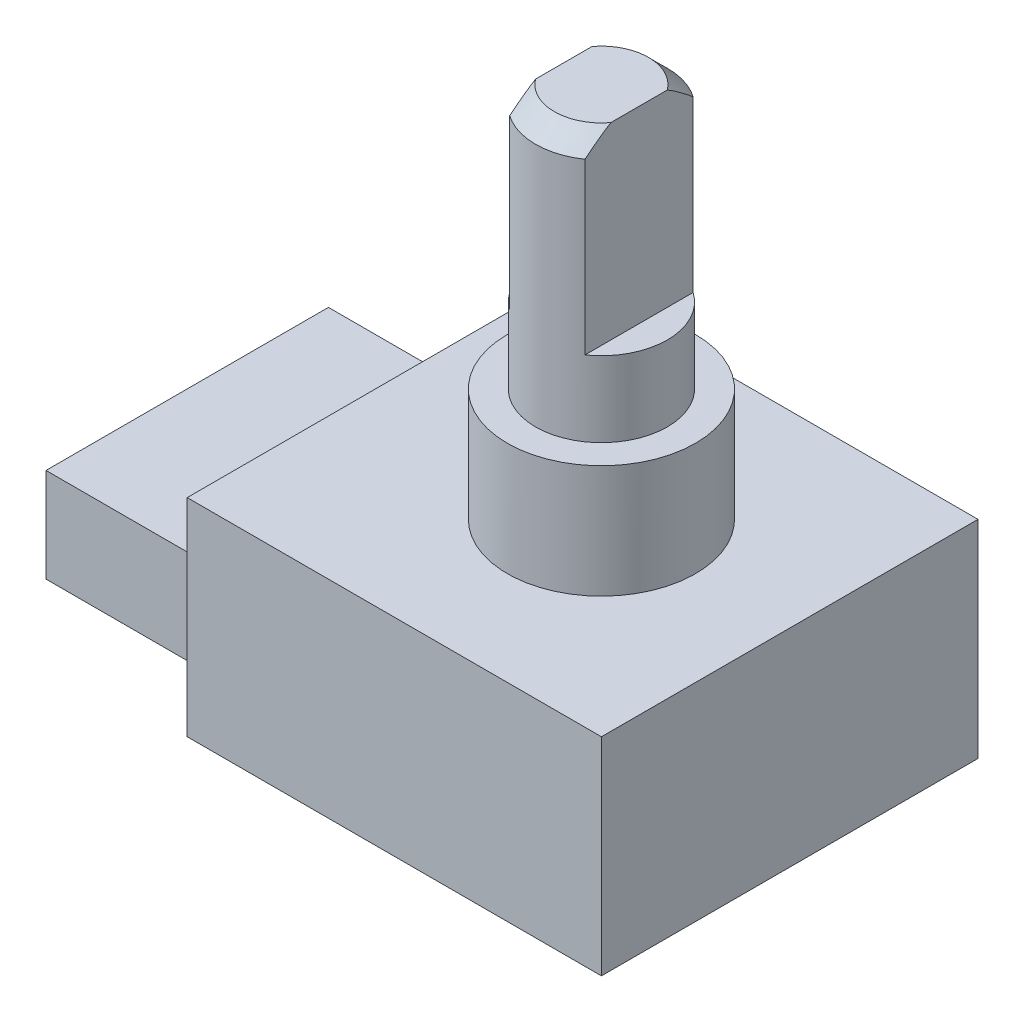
ISO-10303-21;
HEADER;
FILE_DESCRIPTION(('STEP AP214'),'2;1');
FILE_NAME('part.step','',(''),(''),'','','');
FILE_SCHEMA(('AUTOMOTIVE_DESIGN { 1 0 10303 214 1 1 1 1 }'));
ENDSEC;
DATA;
#1=APPLICATION_CONTEXT('core data for automotive mechanical design processes');
#2=APPLICATION_PROTOCOL_DEFINITION('international standard','automotive_design',2000,#1);
#3=PRODUCT_CONTEXT('',#1,'mechanical');
#4=PRODUCT('Part','Part','',(#3));
#5=PRODUCT_RELATED_PRODUCT_CATEGORY('part','',(#4));
#6=PRODUCT_DEFINITION_FORMATION('','',#4);
#7=PRODUCT_DEFINITION_CONTEXT('part definition',#1,'design');
#8=PRODUCT_DEFINITION('design','',#6,#7);
#9=PRODUCT_DEFINITION_SHAPE('','',#8);
#10=(LENGTH_UNIT() NAMED_UNIT(*) SI_UNIT(.MILLI.,.METRE.));
#11=(NAMED_UNIT(*) PLANE_ANGLE_UNIT() SI_UNIT($,.RADIAN.));
#12=(NAMED_UNIT(*) SI_UNIT($,.STERADIAN.) SOLID_ANGLE_UNIT());
#13=UNCERTAINTY_MEASURE_WITH_UNIT(LENGTH_MEASURE(1.E-05),#10,'distance_accuracy_value','');
#14=(GEOMETRIC_REPRESENTATION_CONTEXT(3) GLOBAL_UNCERTAINTY_ASSIGNED_CONTEXT((#13)) GLOBAL_UNIT_ASSIGNED_CONTEXT((#10,
#11,#12)) REPRESENTATION_CONTEXT('',''));
#15=CARTESIAN_POINT('',(0.,0.,0.));
#16=DIRECTION('',(0.,0.,1.));
#17=DIRECTION('',(1.,0.,0.));
#18=AXIS2_PLACEMENT_3D('',#15,#16,#17);
#19=CARTESIAN_POINT('',(-6.,-5.5,5.));
#20=DIRECTION('',(-1.,0.,0.));
#21=DIRECTION('',(0.,0.,1.));
#22=AXIS2_PLACEMENT_3D('',#19,#20,#21);
#23=PLANE('',#22);
#24=DIRECTION('',(0.,0.,1.));
#25=VECTOR('',#24,1.);
#26=CARTESIAN_POINT('',(-6.,0.,5.));
#27=LINE('',#26,#25);
#28=CARTESIAN_POINT('',(-6.,0.,-5.));
#29=VERTEX_POINT('',#28);
#30=CARTESIAN_POINT('',(-6.,0.,5.));
#31=VERTEX_POINT('',#30);
#32=EDGE_CURVE('E184',#29,#31,#27,.T.);
#33=ORIENTED_EDGE('',*,*,#32,.F.);
#34=DIRECTION('',(0.,1.,0.));
#35=VECTOR('',#34,1.);
#36=CARTESIAN_POINT('',(-6.,-5.5,-5.));
#37=LINE('',#36,#35);
#38=CARTESIAN_POINT('',(-6.,-5.5,-5.));
#39=VERTEX_POINT('',#38);
#40=EDGE_CURVE('E194',#39,#29,#37,.T.);
#41=ORIENTED_EDGE('',*,*,#40,.F.);
#42=DIRECTION('',(0.,0.,1.));
#43=VECTOR('',#42,1.);
#44=CARTESIAN_POINT('',(-6.,-5.5,5.));
#45=LINE('',#44,#43);
#46=CARTESIAN_POINT('',(-6.,-5.5,5.));
#47=VERTEX_POINT('',#46);
#48=EDGE_CURVE('E175',#39,#47,#45,.T.);
#49=ORIENTED_EDGE('',*,*,#48,.T.);
#50=DIRECTION('',(0.,1.,0.));
#51=VECTOR('',#50,1.);
#52=CARTESIAN_POINT('',(-6.,-5.5,5.));
#53=LINE('',#52,#51);
#54=EDGE_CURVE('E192',#47,#31,#53,.T.);
#55=ORIENTED_EDGE('',*,*,#54,.T.);
#56=EDGE_LOOP('',(#33,#41,#49,#55));
#57=FACE_BOUND('',#56,.T.);
#58=DIRECTION('',(0.,0.,-1.));
#59=VECTOR('',#58,1.);
#60=CARTESIAN_POINT('',(-6.,-2.5,-3.75));
#61=LINE('',#60,#59);
#62=CARTESIAN_POINT('',(-6.,-2.5,3.75));
#63=VERTEX_POINT('',#62);
#64=CARTESIAN_POINT('',(-6.,-2.5,-3.75));
#65=VERTEX_POINT('',#64);
#66=EDGE_CURVE('E468',#63,#65,#61,.T.);
#67=ORIENTED_EDGE('',*,*,#66,.F.);
#68=DIRECTION('',(0.,1.,0.));
#69=VECTOR('',#68,1.);
#70=CARTESIAN_POINT('',(-6.,-5.,3.75));
#71=LINE('',#70,#69);
#72=CARTESIAN_POINT('',(-6.,-5.,3.75));
#73=VERTEX_POINT('',#72);
#74=EDGE_CURVE('E158',#73,#63,#71,.T.);
#75=ORIENTED_EDGE('',*,*,#74,.F.);
#76=DIRECTION('',(0.,0.,1.));
#77=VECTOR('',#76,1.);
#78=CARTESIAN_POINT('',(-6.,-5.,-3.75));
#79=LINE('',#78,#77);
#80=CARTESIAN_POINT('',(-6.,-5.,-3.75));
#81=VERTEX_POINT('',#80);
#82=EDGE_CURVE('E154',#81,#73,#79,.T.);
#83=ORIENTED_EDGE('',*,*,#82,.F.);
#84=DIRECTION('',(0.,-1.,0.));
#85=VECTOR('',#84,1.);
#86=CARTESIAN_POINT('',(-6.,-5.,-3.75));
#87=LINE('',#86,#85);
#88=EDGE_CURVE('E465',#65,#81,#87,.T.);
#89=ORIENTED_EDGE('',*,*,#88,.F.);
#90=EDGE_LOOP('',(#67,#75,#83,#89));
#91=FACE_BOUND('',#90,.T.);
#92=ADVANCED_FACE('F33',(#57,#91),#23,.T.);
#93=CARTESIAN_POINT('',(0.,10.,0.));
#94=DIRECTION('',(0.,-1.,0.));
#95=DIRECTION('',(0.,0.,-1.));
#96=AXIS2_PLACEMENT_3D('',#93,#94,#95);
#97=CONICAL_SURFACE('',#96,1.25,0.785398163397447);
#98=CARTESIAN_POINT('',(-0.999999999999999,7.37847965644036,3.74014301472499));
#99=CARTESIAN_POINT('',(-0.999999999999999,7.45812378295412,3.65769830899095));
#100=CARTESIAN_POINT('',(-0.999999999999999,7.53768026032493,3.57516874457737));
#101=CARTESIAN_POINT('',(-0.999999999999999,7.69657097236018,3.40989425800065));
#102=CARTESIAN_POINT('',(-0.999999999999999,7.77590520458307,3.32714933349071));
#103=CARTESIAN_POINT('',(-0.999999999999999,8.01357246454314,3.07845151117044));
#104=CARTESIAN_POINT('',(-1.,8.17149860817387,2.91210935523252));
#105=CARTESIAN_POINT('',(-1.,8.48269927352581,2.58092271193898));
#106=CARTESIAN_POINT('',(-1.,8.63600558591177,2.41610827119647));
#107=CARTESIAN_POINT('',(-1.,8.86373760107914,2.16687794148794));
#108=CARTESIAN_POINT('',(-1.,8.93926988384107,2.08347449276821));
#109=CARTESIAN_POINT('',(-1.,9.08929682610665,1.91573988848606));
#110=CARTESIAN_POINT('',(-1.,9.16379151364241,1.83140875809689));
#111=CARTESIAN_POINT('',(-1.,9.28550582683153,1.69114940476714));
#112=CARTESIAN_POINT('',(-1.,9.3331575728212,1.63559662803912));
#113=CARTESIAN_POINT('',(-1.,9.42763505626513,1.52378175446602));
#114=CARTESIAN_POINT('',(-1.,9.47446071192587,1.46751958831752));
#115=CARTESIAN_POINT('',(-1.,9.56747397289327,1.35351140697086));
#116=CARTESIAN_POINT('',(-1.,9.61365026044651,1.29575612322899));
#117=CARTESIAN_POINT('',(-1.,9.7044374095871,1.17902994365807));
#118=CARTESIAN_POINT('',(-1.,9.74904842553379,1.12005916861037));
#119=CARTESIAN_POINT('',(-1.,9.83667548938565,0.999611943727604));
#120=CARTESIAN_POINT('',(-1.,9.8796588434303,0.938111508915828));
#121=CARTESIAN_POINT('',(-1.,9.96225285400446,0.812726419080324));
#122=CARTESIAN_POINT('',(-1.,10.001858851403,0.748838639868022));
#123=CARTESIAN_POINT('',(-1.,10.0752663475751,0.618758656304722));
#124=CARTESIAN_POINT('',(-1.,10.109131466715,0.55260304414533));
#125=CARTESIAN_POINT('',(-1.,10.1683905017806,0.416628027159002));
#126=CARTESIAN_POINT('',(-1.,10.1938125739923,0.346821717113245));
#127=CARTESIAN_POINT('',(-1.,10.2215841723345,0.242195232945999));
#128=CARTESIAN_POINT('',(-1.,10.2289926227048,0.208718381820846));
#129=CARTESIAN_POINT('',(-1.,10.2406262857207,0.141206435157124));
#130=CARTESIAN_POINT('',(-1.,10.2448518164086,0.107171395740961));
#131=CARTESIAN_POINT('',(-1.,10.2498165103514,0.0389626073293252));
#132=CARTESIAN_POINT('',(-1.,10.2505679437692,0.00478977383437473));
#133=CARTESIAN_POINT('',(-1.,10.2485720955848,-0.063446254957));
#134=CARTESIAN_POINT('',(-1.,10.2458245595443,-0.0975094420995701));
#135=CARTESIAN_POINT('',(-1.,10.2326534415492,-0.198485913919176));
#136=CARTESIAN_POINT('',(-1.,10.2173405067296,-0.264795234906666));
#137=CARTESIAN_POINT('',(-1.,10.1869693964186,-0.361949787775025));
#138=CARTESIAN_POINT('',(-1.,10.1755588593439,-0.394058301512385));
#139=CARTESIAN_POINT('',(-1.,10.1507071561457,-0.457481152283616));
#140=CARTESIAN_POINT('',(-1.,10.1372663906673,-0.488795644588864));
#141=CARTESIAN_POINT('',(-1.,10.0950781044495,-0.58030178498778));
#142=CARTESIAN_POINT('',(-1.,10.0640041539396,-0.639412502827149));
#143=CARTESIAN_POINT('',(-1.,9.99771844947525,-0.755290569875));
#144=CARTESIAN_POINT('',(-1.,9.96250174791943,-0.81205500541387));
#145=CARTESIAN_POINT('',(-1.,9.88914738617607,-0.923964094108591));
#146=CARTESIAN_POINT('',(-1.,9.85099886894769,-0.97910156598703));
#147=CARTESIAN_POINT('',(-1.,9.77277718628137,-1.0879408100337));
#148=CARTESIAN_POINT('',(-1.,9.73270494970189,-1.14164325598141));
#149=CARTESIAN_POINT('',(-1.,9.65063514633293,-1.2486640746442));
#150=CARTESIAN_POINT('',(-1.,9.60861932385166,-1.30196838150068));
#151=CARTESIAN_POINT('',(-1.,9.52352678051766,-1.40772530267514));
#152=CARTESIAN_POINT('',(-1.,9.48044999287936,-1.46017786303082));
#153=CARTESIAN_POINT('',(-1.,9.35023924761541,-1.61629570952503));
#154=CARTESIAN_POINT('',(-1.,9.26192557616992,-1.71897545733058));
#155=CARTESIAN_POINT('',(-1.,9.09901124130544,-1.90482501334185));
#156=CARTESIAN_POINT('',(-1.,9.02471531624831,-1.98826458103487));
#157=CARTESIAN_POINT('',(-1.,8.87518823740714,-2.15430555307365));
#158=CARTESIAN_POINT('',(-1.,8.79995705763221,-2.23690693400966));
#159=CARTESIAN_POINT('',(-1.,8.57312266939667,-2.48394235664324));
#160=CARTESIAN_POINT('',(-1.,8.4205159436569,-2.64745315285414));
#161=CARTESIAN_POINT('',(-1.,8.12005063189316,-2.96635625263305));
#162=CARTESIAN_POINT('',(-0.999999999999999,7.97225355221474,-3.12180679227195));
#163=CARTESIAN_POINT('',(-0.999999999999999,7.74994645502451,-3.35423325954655));
#164=CARTESIAN_POINT('',(-0.999999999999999,7.67578335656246,-3.43154131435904));
#165=CARTESIAN_POINT('',(-0.999999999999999,7.52726566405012,-3.58597203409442));
#166=CARTESIAN_POINT('',(-0.999999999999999,7.45291107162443,-3.66309470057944));
#167=CARTESIAN_POINT('',(-0.999999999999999,7.37847965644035,-3.74014301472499));
#168=B_SPLINE_CURVE_WITH_KNOTS('',3,(#98,#99,#100,#101,#102,#103,#104,#105,#106,#107,#108,#109,
#110,#111,#112,#113,#114,#115,#116,#117,#118,#119,#120,#121,#122,#123,#124,#125,#126,#127,#128,
#129,#130,#131,#132,#133,#134,#135,#136,#137,#138,#139,#140,#141,#142,#143,#144,#145,#146,#147,
#148,#149,#150,#151,#152,#153,#154,#155,#156,#157,#158,#159,#160,#161,#162,#163,#164,#165,#166,
#167),.UNSPECIFIED.,.F.,.F.,(4,2,2,2,2,2,2,2,2,2,2,2,2,2,2,2,2,2,2,2,2,2,2,2,2,2,2,2,2,2,2,2,2,
2,4),(0.,0.343893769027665,0.687791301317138,1.37589449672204,2.05114695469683,2.38870835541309,
2.72626061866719,2.94582517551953,3.16541135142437,3.38722873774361,3.60902418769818,
3.83405004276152,4.05938146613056,4.28202423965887,4.50391689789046,4.60664819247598,
4.70936922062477,4.81172716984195,4.91409256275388,5.11702527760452,5.21921139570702,
5.3213773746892,5.52143783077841,5.72173968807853,5.92282279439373,6.12380976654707,
6.32740925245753,6.53102158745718,6.9372774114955,7.27244062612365,7.60761317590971,
8.27857837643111,8.92206442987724,9.24345220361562,9.56483725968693),.UNSPECIFIED.);
#169=CARTESIAN_POINT('',(-1.,9.49999999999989,1.43614066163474));
#170=VERTEX_POINT('',#169);
#171=CARTESIAN_POINT('',(-1.,10.,0.749999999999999));
#172=VERTEX_POINT('',#171);
#173=EDGE_CURVE('E42',#170,#172,#168,.T.);
#174=ORIENTED_EDGE('',*,*,#173,.F.);
#175=CARTESIAN_POINT('',(0.,9.5,0.));
#176=DIRECTION('',(0.,1.,0.));
#177=DIRECTION('',(0.,0.,1.));
#178=AXIS2_PLACEMENT_3D('',#175,#176,#177);
#179=CIRCLE('',#178,1.75);
#180=CARTESIAN_POINT('',(1.,9.49999999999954,1.43614066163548));
#181=VERTEX_POINT('',#180);
#182=EDGE_CURVE('E232',#181,#170,#179,.F.);
#183=ORIENTED_EDGE('',*,*,#182,.F.);
#184=CARTESIAN_POINT('',(1.,7.37847965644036,-3.74014301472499));
#185=CARTESIAN_POINT('',(1.,7.45812378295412,-3.65769830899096));
#186=CARTESIAN_POINT('',(1.,7.53768026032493,-3.57516874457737));
#187=CARTESIAN_POINT('',(1.,7.69657097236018,-3.40989425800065));
#188=CARTESIAN_POINT('',(1.,7.77590520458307,-3.32714933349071));
#189=CARTESIAN_POINT('',(1.,8.01357246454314,-3.07845151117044));
#190=CARTESIAN_POINT('',(1.,8.17149860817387,-2.91210935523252));
#191=CARTESIAN_POINT('',(1.,8.48269927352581,-2.58092271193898));
#192=CARTESIAN_POINT('',(1.,8.63600558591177,-2.41610827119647));
#193=CARTESIAN_POINT('',(1.,8.86373760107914,-2.16687794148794));
#194=CARTESIAN_POINT('',(1.,8.93926988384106,-2.08347449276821));
#195=CARTESIAN_POINT('',(1.,9.08929682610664,-1.91573988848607));
#196=CARTESIAN_POINT('',(1.,9.16379151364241,-1.83140875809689));
#197=CARTESIAN_POINT('',(1.,9.28550582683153,-1.69114940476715));
#198=CARTESIAN_POINT('',(1.,9.3331575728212,-1.63559662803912));
#199=CARTESIAN_POINT('',(1.,9.42763505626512,-1.52378175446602));
#200=CARTESIAN_POINT('',(1.,9.47446071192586,-1.46751958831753));
#201=CARTESIAN_POINT('',(1.,9.56747397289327,-1.35351140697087));
#202=CARTESIAN_POINT('',(1.,9.6136502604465,-1.29575612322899));
#203=CARTESIAN_POINT('',(1.,9.7044374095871,-1.17902994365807));
#204=CARTESIAN_POINT('',(1.,9.74904842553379,-1.12005916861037));
#205=CARTESIAN_POINT('',(1.,9.83667548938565,-0.999611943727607));
#206=CARTESIAN_POINT('',(1.,9.8796588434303,-0.93811150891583));
#207=CARTESIAN_POINT('',(1.,9.96225285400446,-0.812726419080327));
#208=CARTESIAN_POINT('',(1.,10.001858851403,-0.748838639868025));
#209=CARTESIAN_POINT('',(1.,10.0752663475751,-0.618758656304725));
#210=CARTESIAN_POINT('',(1.,10.109131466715,-0.552603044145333));
#211=CARTESIAN_POINT('',(1.,10.1683905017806,-0.416628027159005));
#212=CARTESIAN_POINT('',(1.,10.1938125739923,-0.346821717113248));
#213=CARTESIAN_POINT('',(1.,10.2215841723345,-0.242195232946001));
#214=CARTESIAN_POINT('',(1.,10.2289926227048,-0.208718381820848));
#215=CARTESIAN_POINT('',(1.,10.2406262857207,-0.141206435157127));
#216=CARTESIAN_POINT('',(1.,10.2448518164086,-0.107171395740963));
#217=CARTESIAN_POINT('',(1.,10.2498165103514,-0.0389626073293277));
#218=CARTESIAN_POINT('',(1.,10.2505679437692,-0.0047897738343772));
#219=CARTESIAN_POINT('',(1.,10.2485720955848,0.0634462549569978));
#220=CARTESIAN_POINT('',(1.,10.2458245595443,0.0975094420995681));
#221=CARTESIAN_POINT('',(1.,10.2326534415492,0.198485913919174));
#222=CARTESIAN_POINT('',(1.,10.2173405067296,0.264795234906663));
#223=CARTESIAN_POINT('',(1.,10.1869693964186,0.361949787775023));
#224=CARTESIAN_POINT('',(1.,10.1755588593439,0.394058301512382));
#225=CARTESIAN_POINT('',(1.,10.1507071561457,0.457481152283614));
#226=CARTESIAN_POINT('',(1.,10.1372663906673,0.488795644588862));
#227=CARTESIAN_POINT('',(1.,10.0950781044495,0.580301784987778));
#228=CARTESIAN_POINT('',(1.,10.0640041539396,0.639412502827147));
#229=CARTESIAN_POINT('',(1.,9.99771844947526,0.755290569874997));
#230=CARTESIAN_POINT('',(1.,9.96250174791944,0.812055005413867));
#231=CARTESIAN_POINT('',(1.,9.88914738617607,0.923964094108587));
#232=CARTESIAN_POINT('',(1.,9.8509988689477,0.979101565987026));
#233=CARTESIAN_POINT('',(1.,9.77277718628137,1.0879408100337));
#234=CARTESIAN_POINT('',(1.,9.73270494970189,1.14164325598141));
#235=CARTESIAN_POINT('',(1.,9.65063514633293,1.2486640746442));
#236=CARTESIAN_POINT('',(1.,9.60861932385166,1.30196838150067));
#237=CARTESIAN_POINT('',(1.,9.52352678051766,1.40772530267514));
#238=CARTESIAN_POINT('',(1.,9.48044999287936,1.46017786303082));
#239=CARTESIAN_POINT('',(1.,9.35023924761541,1.61629570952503));
#240=CARTESIAN_POINT('',(1.,9.26192557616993,1.71897545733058));
#241=CARTESIAN_POINT('',(1.,9.09901124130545,1.90482501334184));
#242=CARTESIAN_POINT('',(1.,9.02471531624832,1.98826458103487));
#243=CARTESIAN_POINT('',(1.,8.87518823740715,2.15430555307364));
#244=CARTESIAN_POINT('',(1.,8.79995705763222,2.23690693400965));
#245=CARTESIAN_POINT('',(1.,8.57312266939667,2.48394235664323));
#246=CARTESIAN_POINT('',(1.,8.4205159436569,2.64745315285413));
#247=CARTESIAN_POINT('',(1.,8.12005063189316,2.96635625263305));
#248=CARTESIAN_POINT('',(1.,7.97225355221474,3.12180679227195));
#249=CARTESIAN_POINT('',(1.,7.74994645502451,3.35423325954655));
#250=CARTESIAN_POINT('',(1.,7.67578335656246,3.43154131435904));
#251=CARTESIAN_POINT('',(1.,7.52726566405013,3.58597203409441));
#252=CARTESIAN_POINT('',(1.,7.45291107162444,3.66309470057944));
#253=CARTESIAN_POINT('',(1.,7.37847965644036,3.74014301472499));
#254=B_SPLINE_CURVE_WITH_KNOTS('',3,(#184,#185,#186,#187,#188,#189,#190,#191,#192,#193,#194,
#195,#196,#197,#198,#199,#200,#201,#202,#203,#204,#205,#206,#207,#208,#209,#210,#211,#212,#213,
#214,#215,#216,#217,#218,#219,#220,#221,#222,#223,#224,#225,#226,#227,#228,#229,#230,#231,#232,
#233,#234,#235,#236,#237,#238,#239,#240,#241,#242,#243,#244,#245,#246,#247,#248,#249,#250,#251,
#252,#253),.UNSPECIFIED.,.F.,.F.,(4,2,2,2,2,2,2,2,2,2,2,2,2,2,2,2,2,2,2,2,2,2,2,2,2,2,2,2,2,2,2,
2,2,2,4),(0.,0.343893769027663,0.687791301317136,1.37589449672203,2.05114695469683,
2.38870835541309,2.72626061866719,2.94582517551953,3.16541135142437,3.3872287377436,
3.60902418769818,3.83405004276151,4.05938146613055,4.28202423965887,4.50391689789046,
4.60664819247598,4.70936922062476,4.81172716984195,4.91409256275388,5.11702527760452,
5.21921139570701,5.3213773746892,5.5214378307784,5.72173968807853,5.92282279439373,
6.12380976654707,6.32740925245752,6.53102158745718,6.9372774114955,7.27244062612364,
7.60761317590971,8.27857837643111,8.92206442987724,9.24345220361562,9.56483725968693),.UNSPECIFIED.);
#255=CARTESIAN_POINT('',(1.,10.,0.749999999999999));
#256=VERTEX_POINT('',#255);
#257=EDGE_CURVE('E235',#256,#181,#254,.T.);
#258=ORIENTED_EDGE('',*,*,#257,.F.);
#259=CARTESIAN_POINT('',(0.,10.,0.));
#260=DIRECTION('',(0.,1.,0.));
#261=DIRECTION('',(0.,0.,1.));
#262=AXIS2_PLACEMENT_3D('',#259,#260,#261);
#263=CIRCLE('',#262,1.25);
#264=EDGE_CURVE('E227',#172,#256,#263,.T.);
#265=ORIENTED_EDGE('',*,*,#264,.F.);
#266=EDGE_LOOP('',(#174,#183,#258,#265));
#267=FACE_BOUND('',#266,.T.);
#268=ADVANCED_FACE('F263',(#267),#97,.T.);
#269=CARTESIAN_POINT('',(0.,3.,0.));
#270=DIRECTION('',(0.,1.,0.));
#271=DIRECTION('',(0.,0.,1.));
#272=AXIS2_PLACEMENT_3D('',#269,#270,#271);
#273=PLANE('',#272);
#274=CARTESIAN_POINT('',(0.,3.,0.));
#275=DIRECTION('',(0.,1.,0.));
#276=DIRECTION('',(0.,0.,1.));
#277=AXIS2_PLACEMENT_3D('',#274,#275,#276);
#278=CIRCLE('',#277,2.5);
#279=CARTESIAN_POINT('',(0.,3.,2.5));
#280=VERTEX_POINT('',#279);
#281=EDGE_CURVE('E224',#280,#280,#278,.T.);
#282=ORIENTED_EDGE('',*,*,#281,.T.);
#283=EDGE_LOOP('',(#282));
#284=FACE_BOUND('',#283,.T.);
#285=CARTESIAN_POINT('',(0.,3.,0.));
#286=DIRECTION('',(0.,1.,0.));
#287=DIRECTION('',(0.,0.,1.));
#288=AXIS2_PLACEMENT_3D('',#285,#286,#287);
#289=CIRCLE('',#288,1.75);
#290=CARTESIAN_POINT('',(0.,3.,1.75));
#291=VERTEX_POINT('',#290);
#292=EDGE_CURVE('E221',#291,#291,#289,.T.);
#293=ORIENTED_EDGE('',*,*,#292,.F.);
#294=EDGE_LOOP('',(#293));
#295=FACE_BOUND('',#294,.T.);
#296=ADVANCED_FACE('F261',(#284,#295),#273,.T.);
#297=CARTESIAN_POINT('',(0.,3.,0.));
#298=DIRECTION('',(0.,-1.,0.));
#299=DIRECTION('',(0.,0.,-1.));
#300=AXIS2_PLACEMENT_3D('',#297,#298,#299);
#301=CYLINDRICAL_SURFACE('',#300,2.5);
#302=ORIENTED_EDGE('',*,*,#281,.F.);
#303=EDGE_LOOP('',(#302));
#304=FACE_BOUND('',#303,.T.);
#305=CARTESIAN_POINT('',(0.,0.,0.));
#306=DIRECTION('',(0.,-1.,0.));
#307=DIRECTION('',(0.,0.,-1.));
#308=AXIS2_PLACEMENT_3D('',#305,#306,#307);
#309=CIRCLE('',#308,2.5);
#310=CARTESIAN_POINT('',(0.,0.,-2.5));
#311=VERTEX_POINT('',#310);
#312=EDGE_CURVE('E191',#311,#311,#309,.T.);
#313=ORIENTED_EDGE('',*,*,#312,.F.);
#314=EDGE_LOOP('',(#313));
#315=FACE_BOUND('',#314,.T.);
#316=ADVANCED_FACE('F259',(#304,#315),#301,.T.);
#317=CARTESIAN_POINT('',(0.,10.,0.));
#318=DIRECTION('',(0.,-1.,0.));
#319=DIRECTION('',(0.,0.,-1.));
#320=AXIS2_PLACEMENT_3D('',#317,#318,#319);
#321=CYLINDRICAL_SURFACE('',#320,1.75);
#322=ORIENTED_EDGE('',*,*,#182,.T.);
#323=DIRECTION('',(0.,-1.,0.));
#324=VECTOR('',#323,1.);
#325=CARTESIAN_POINT('',(-1.,10.,1.43614066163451));
#326=LINE('',#325,#324);
#327=CARTESIAN_POINT('',(-0.999999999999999,5.,1.43614066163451));
#328=VERTEX_POINT('',#327);
#329=EDGE_CURVE('E206',#170,#328,#326,.T.);
#330=ORIENTED_EDGE('',*,*,#329,.T.);
#331=CARTESIAN_POINT('',(0.,5.,0.));
#332=DIRECTION('',(0.,-1.,0.));
#333=DIRECTION('',(0.,0.,-1.));
#334=AXIS2_PLACEMENT_3D('',#331,#332,#333);
#335=CIRCLE('',#334,1.75);
#336=CARTESIAN_POINT('',(-0.999999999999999,5.,-1.43614066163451));
#337=VERTEX_POINT('',#336);
#338=EDGE_CURVE('E11',#328,#337,#335,.T.);
#339=ORIENTED_EDGE('',*,*,#338,.T.);
#340=DIRECTION('',(0.,-1.,0.));
#341=VECTOR('',#340,1.);
#342=CARTESIAN_POINT('',(-1.,10.,-1.43614066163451));
#343=LINE('',#342,#341);
#344=CARTESIAN_POINT('',(-1.,9.49999999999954,-1.43614066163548));
#345=VERTEX_POINT('',#344);
#346=EDGE_CURVE('E201',#337,#345,#343,.F.);
#347=ORIENTED_EDGE('',*,*,#346,.T.);
#348=CARTESIAN_POINT('',(1.,9.49999999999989,-1.43614066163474));
#349=VERTEX_POINT('',#348);
#350=EDGE_CURVE('E231',#345,#349,#179,.F.);
#351=ORIENTED_EDGE('',*,*,#350,.T.);
#352=DIRECTION('',(0.,-1.,0.));
#353=VECTOR('',#352,1.);
#354=CARTESIAN_POINT('',(1.,10.,-1.43614066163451));
#355=LINE('',#354,#353);
#356=CARTESIAN_POINT('',(1.,5.,-1.43614066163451));
#357=VERTEX_POINT('',#356);
#358=EDGE_CURVE('E218',#349,#357,#355,.T.);
#359=ORIENTED_EDGE('',*,*,#358,.T.);
#360=CARTESIAN_POINT('',(0.,5.,0.));
#361=DIRECTION('',(0.,-1.,0.));
#362=DIRECTION('',(0.,0.,-1.));
#363=AXIS2_PLACEMENT_3D('',#360,#361,#362);
#364=CIRCLE('',#363,1.75);
#365=CARTESIAN_POINT('',(1.,5.,1.43614066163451));
#366=VERTEX_POINT('',#365);
#367=EDGE_CURVE('E242',#357,#366,#364,.T.);
#368=ORIENTED_EDGE('',*,*,#367,.T.);
#369=DIRECTION('',(0.,-1.,0.));
#370=VECTOR('',#369,1.);
#371=CARTESIAN_POINT('',(1.,10.,1.43614066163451));
#372=LINE('',#371,#370);
#373=EDGE_CURVE('E213',#366,#181,#372,.F.);
#374=ORIENTED_EDGE('',*,*,#373,.T.);
#375=EDGE_LOOP('',(#322,#330,#339,#347,#351,#359,#368,#374));
#376=FACE_BOUND('',#375,.T.);
#377=ORIENTED_EDGE('',*,*,#292,.T.);
#378=EDGE_LOOP('',(#377));
#379=FACE_BOUND('',#378,.T.);
#380=ADVANCED_FACE('F255',(#376,#379),#321,.T.);
#381=CARTESIAN_POINT('',(0.,10.,0.));
#382=DIRECTION('',(0.,1.,0.));
#383=DIRECTION('',(0.,0.,1.));
#384=AXIS2_PLACEMENT_3D('',#381,#382,#383);
#385=PLANE('',#384);
#386=DIRECTION('',(0.,0.,1.));
#387=VECTOR('',#386,1.);
#388=CARTESIAN_POINT('',(-1.,10.,-2.5));
#389=LINE('',#388,#387);
#390=CARTESIAN_POINT('',(-1.,10.,-0.749999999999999));
#391=VERTEX_POINT('',#390);
#392=EDGE_CURVE('E57',#391,#172,#389,.T.);
#393=ORIENTED_EDGE('',*,*,#392,.T.);
#394=ORIENTED_EDGE('',*,*,#264,.T.);
#395=DIRECTION('',(0.,0.,1.));
#396=VECTOR('',#395,1.);
#397=CARTESIAN_POINT('',(1.,10.,-2.5));
#398=LINE('',#397,#396);
#399=CARTESIAN_POINT('',(1.,10.,-0.749999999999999));
#400=VERTEX_POINT('',#399);
#401=EDGE_CURVE('E209',#400,#256,#398,.T.);
#402=ORIENTED_EDGE('',*,*,#401,.F.);
#403=EDGE_CURVE('E228',#400,#391,#263,.T.);
#404=ORIENTED_EDGE('',*,*,#403,.T.);
#405=EDGE_LOOP('',(#393,#394,#402,#404));
#406=FACE_BOUND('',#405,.T.);
#407=ADVANCED_FACE('F252',(#406),#385,.T.);
#408=EDGE_CURVE('E297',#391,#345,#168,.T.);
#409=ORIENTED_EDGE('',*,*,#408,.F.);
#410=ORIENTED_EDGE('',*,*,#403,.F.);
#411=EDGE_CURVE('E241',#349,#400,#254,.T.);
#412=ORIENTED_EDGE('',*,*,#411,.F.);
#413=ORIENTED_EDGE('',*,*,#350,.F.);
#414=EDGE_LOOP('',(#409,#410,#412,#413));
#415=FACE_BOUND('',#414,.T.);
#416=ADVANCED_FACE('F35',(#415),#97,.T.);
#417=CARTESIAN_POINT('',(1.,5.,-2.5));
#418=DIRECTION('',(0.,-1.,0.));
#419=DIRECTION('',(0.,0.,-1.));
#420=AXIS2_PLACEMENT_3D('',#417,#418,#419);
#421=PLANE('',#420);
#422=DIRECTION('',(0.,0.,1.));
#423=VECTOR('',#422,1.);
#424=CARTESIAN_POINT('',(1.,5.,-2.5));
#425=LINE('',#424,#423);
#426=EDGE_CURVE('E210',#357,#366,#425,.T.);
#427=ORIENTED_EDGE('',*,*,#426,.T.);
#428=ORIENTED_EDGE('',*,*,#367,.F.);
#429=EDGE_LOOP('',(#427,#428));
#430=FACE_BOUND('',#429,.T.);
#431=ADVANCED_FACE('F249',(#430),#421,.F.);
#432=CARTESIAN_POINT('',(1.,10.,-2.5));
#433=DIRECTION('',(-1.,0.,0.));
#434=DIRECTION('',(0.,-1.,0.));
#435=AXIS2_PLACEMENT_3D('',#432,#433,#434);
#436=PLANE('',#435);
#437=ORIENTED_EDGE('',*,*,#411,.T.);
#438=ORIENTED_EDGE('',*,*,#401,.T.);
#439=ORIENTED_EDGE('',*,*,#257,.T.);
#440=ORIENTED_EDGE('',*,*,#373,.F.);
#441=ORIENTED_EDGE('',*,*,#426,.F.);
#442=ORIENTED_EDGE('',*,*,#358,.F.);
#443=EDGE_LOOP('',(#437,#438,#439,#440,#441,#442));
#444=FACE_BOUND('',#443,.T.);
#445=ADVANCED_FACE('F243',(#444),#436,.F.);
#446=CARTESIAN_POINT('',(-0.999999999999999,5.,-2.5));
#447=DIRECTION('',(0.,-1.,0.));
#448=DIRECTION('',(0.,0.,-1.));
#449=AXIS2_PLACEMENT_3D('',#446,#447,#448);
#450=PLANE('',#449);
#451=DIRECTION('',(0.,0.,1.));
#452=VECTOR('',#451,1.);
#453=CARTESIAN_POINT('',(-0.999999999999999,5.,-2.5));
#454=LINE('',#453,#452);
#455=EDGE_CURVE('E199',#337,#328,#454,.T.);
#456=ORIENTED_EDGE('',*,*,#455,.F.);
#457=ORIENTED_EDGE('',*,*,#338,.F.);
#458=EDGE_LOOP('',(#456,#457));
#459=FACE_BOUND('',#458,.T.);
#460=ADVANCED_FACE('F248',(#459),#450,.F.);
#461=CARTESIAN_POINT('',(-1.,10.,-2.5));
#462=DIRECTION('',(1.,0.,0.));
#463=DIRECTION('',(0.,1.,0.));
#464=AXIS2_PLACEMENT_3D('',#461,#462,#463);
#465=PLANE('',#464);
#466=ORIENTED_EDGE('',*,*,#173,.T.);
#467=ORIENTED_EDGE('',*,*,#392,.F.);
#468=ORIENTED_EDGE('',*,*,#408,.T.);
#469=ORIENTED_EDGE('',*,*,#346,.F.);
#470=ORIENTED_EDGE('',*,*,#455,.T.);
#471=ORIENTED_EDGE('',*,*,#329,.F.);
#472=EDGE_LOOP('',(#466,#467,#468,#469,#470,#471));
#473=FACE_BOUND('',#472,.T.);
#474=ADVANCED_FACE('F294',(#473),#465,.F.);
#475=CARTESIAN_POINT('',(0.,0.,0.));
#476=DIRECTION('',(0.,-1.,0.));
#477=DIRECTION('',(0.,0.,-1.));
#478=AXIS2_PLACEMENT_3D('',#475,#476,#477);
#479=PLANE('',#478);
#480=DIRECTION('',(0.,0.,-1.));
#481=VECTOR('',#480,1.);
#482=CARTESIAN_POINT('',(5.,0.,5.));
#483=LINE('',#482,#481);
#484=CARTESIAN_POINT('',(5.,0.,5.));
#485=VERTEX_POINT('',#484);
#486=CARTESIAN_POINT('',(5.,0.,-5.));
#487=VERTEX_POINT('',#486);
#488=EDGE_CURVE('E160',#485,#487,#483,.T.);
#489=ORIENTED_EDGE('',*,*,#488,.T.);
#490=DIRECTION('',(-1.,0.,0.));
#491=VECTOR('',#490,1.);
#492=CARTESIAN_POINT('',(-6.,0.,-5.));
#493=LINE('',#492,#491);
#494=EDGE_CURVE('E163',#487,#29,#493,.T.);
#495=ORIENTED_EDGE('',*,*,#494,.T.);
#496=ORIENTED_EDGE('',*,*,#32,.T.);
#497=DIRECTION('',(1.,0.,0.));
#498=VECTOR('',#497,1.);
#499=CARTESIAN_POINT('',(-6.,0.,5.));
#500=LINE('',#499,#498);
#501=EDGE_CURVE('E172',#31,#485,#500,.T.);
#502=ORIENTED_EDGE('',*,*,#501,.T.);
#503=EDGE_LOOP('',(#489,#495,#496,#502));
#504=FACE_BOUND('',#503,.T.);
#505=ORIENTED_EDGE('',*,*,#312,.T.);
#506=EDGE_LOOP('',(#505));
#507=FACE_BOUND('',#506,.T.);
#508=ADVANCED_FACE('F292',(#504,#507),#479,.F.);
#509=CARTESIAN_POINT('',(5.,-5.5,5.));
#510=DIRECTION('',(1.,0.,0.));
#511=DIRECTION('',(0.,0.,-1.));
#512=AXIS2_PLACEMENT_3D('',#509,#510,#511);
#513=PLANE('',#512);
#514=ORIENTED_EDGE('',*,*,#488,.F.);
#515=DIRECTION('',(0.,1.,0.));
#516=VECTOR('',#515,1.);
#517=CARTESIAN_POINT('',(5.,-5.5,5.));
#518=LINE('',#517,#516);
#519=CARTESIAN_POINT('',(5.,-5.5,5.));
#520=VERTEX_POINT('',#519);
#521=EDGE_CURVE('E189',#520,#485,#518,.T.);
#522=ORIENTED_EDGE('',*,*,#521,.F.);
#523=DIRECTION('',(0.,0.,-1.));
#524=VECTOR('',#523,1.);
#525=CARTESIAN_POINT('',(5.,-5.5,5.));
#526=LINE('',#525,#524);
#527=CARTESIAN_POINT('',(5.,-5.5,-5.));
#528=VERTEX_POINT('',#527);
#529=EDGE_CURVE('E168',#520,#528,#526,.T.);
#530=ORIENTED_EDGE('',*,*,#529,.T.);
#531=DIRECTION('',(0.,1.,0.));
#532=VECTOR('',#531,1.);
#533=CARTESIAN_POINT('',(5.,-5.5,-5.));
#534=LINE('',#533,#532);
#535=EDGE_CURVE('E180',#528,#487,#534,.T.);
#536=ORIENTED_EDGE('',*,*,#535,.T.);
#537=EDGE_LOOP('',(#514,#522,#530,#536));
#538=FACE_BOUND('',#537,.T.);
#539=ADVANCED_FACE('F289',(#538),#513,.T.);
#540=CARTESIAN_POINT('',(-6.,-5.5,5.));
#541=DIRECTION('',(0.,0.,1.));
#542=DIRECTION('',(1.,0.,0.));
#543=AXIS2_PLACEMENT_3D('',#540,#541,#542);
#544=PLANE('',#543);
#545=ORIENTED_EDGE('',*,*,#501,.F.);
#546=ORIENTED_EDGE('',*,*,#54,.F.);
#547=DIRECTION('',(1.,0.,0.));
#548=VECTOR('',#547,1.);
#549=CARTESIAN_POINT('',(-6.,-5.5,5.));
#550=LINE('',#549,#548);
#551=EDGE_CURVE('E178',#47,#520,#550,.T.);
#552=ORIENTED_EDGE('',*,*,#551,.T.);
#553=ORIENTED_EDGE('',*,*,#521,.T.);
#554=EDGE_LOOP('',(#545,#546,#552,#553));
#555=FACE_BOUND('',#554,.T.);
#556=ADVANCED_FACE('F282',(#555),#544,.T.);
#557=CARTESIAN_POINT('',(-6.,-5.5,-5.));
#558=DIRECTION('',(0.,0.,-1.));
#559=DIRECTION('',(-1.,0.,0.));
#560=AXIS2_PLACEMENT_3D('',#557,#558,#559);
#561=PLANE('',#560);
#562=ORIENTED_EDGE('',*,*,#494,.F.);
#563=ORIENTED_EDGE('',*,*,#535,.F.);
#564=DIRECTION('',(-1.,0.,0.));
#565=VECTOR('',#564,1.);
#566=CARTESIAN_POINT('',(-6.,-5.5,-5.));
#567=LINE('',#566,#565);
#568=EDGE_CURVE('E171',#528,#39,#567,.T.);
#569=ORIENTED_EDGE('',*,*,#568,.T.);
#570=ORIENTED_EDGE('',*,*,#40,.T.);
#571=EDGE_LOOP('',(#562,#563,#569,#570));
#572=FACE_BOUND('',#571,.T.);
#573=ADVANCED_FACE('F284',(#572),#561,.T.);
#574=CARTESIAN_POINT('',(0.,-5.5,0.));
#575=DIRECTION('',(0.,-1.,0.));
#576=DIRECTION('',(0.,0.,-1.));
#577=AXIS2_PLACEMENT_3D('',#574,#575,#576);
#578=PLANE('',#577);
#579=ORIENTED_EDGE('',*,*,#529,.F.);
#580=ORIENTED_EDGE('',*,*,#551,.F.);
#581=ORIENTED_EDGE('',*,*,#48,.F.);
#582=ORIENTED_EDGE('',*,*,#568,.F.);
#583=EDGE_LOOP('',(#579,#580,#581,#582));
#584=FACE_BOUND('',#583,.T.);
#585=ADVANCED_FACE('F287',(#584),#578,.T.);
#586=CARTESIAN_POINT('',(-11.,-5.,3.75));
#587=DIRECTION('',(0.,0.,-1.));
#588=DIRECTION('',(-1.,0.,0.));
#589=AXIS2_PLACEMENT_3D('',#586,#587,#588);
#590=PLANE('',#589);
#591=ORIENTED_EDGE('',*,*,#74,.T.);
#592=DIRECTION('',(1.,0.,0.));
#593=VECTOR('',#592,1.);
#594=CARTESIAN_POINT('',(-11.,-2.5,3.75));
#595=LINE('',#594,#593);
#596=CARTESIAN_POINT('',(-11.,-2.5,3.75));
#597=VERTEX_POINT('',#596);
#598=EDGE_CURVE('E139',#597,#63,#595,.T.);
#599=ORIENTED_EDGE('',*,*,#598,.F.);
#600=DIRECTION('',(0.,1.,0.));
#601=VECTOR('',#600,1.);
#602=CARTESIAN_POINT('',(-11.,-5.,3.75));
#603=LINE('',#602,#601);
#604=CARTESIAN_POINT('',(-11.,-5.,3.75));
#605=VERTEX_POINT('',#604);
#606=EDGE_CURVE('E146',#605,#597,#603,.T.);
#607=ORIENTED_EDGE('',*,*,#606,.F.);
#608=DIRECTION('',(1.,0.,0.));
#609=VECTOR('',#608,1.);
#610=CARTESIAN_POINT('',(-11.,-5.,3.75));
#611=LINE('',#610,#609);
#612=EDGE_CURVE('E463',#605,#73,#611,.T.);
#613=ORIENTED_EDGE('',*,*,#612,.T.);
#614=EDGE_LOOP('',(#591,#599,#607,#613));
#615=FACE_BOUND('',#614,.T.);
#616=ADVANCED_FACE('F156',(#615),#590,.F.);
#617=CARTESIAN_POINT('',(-11.,-2.5,-3.75));
#618=DIRECTION('',(0.,-1.,0.));
#619=DIRECTION('',(0.,0.,-1.));
#620=AXIS2_PLACEMENT_3D('',#617,#618,#619);
#621=PLANE('',#620);
#622=ORIENTED_EDGE('',*,*,#66,.T.);
#623=DIRECTION('',(1.,0.,0.));
#624=VECTOR('',#623,1.);
#625=CARTESIAN_POINT('',(-11.,-2.5,-3.75));
#626=LINE('',#625,#624);
#627=CARTESIAN_POINT('',(-11.,-2.5,-3.75));
#628=VERTEX_POINT('',#627);
#629=EDGE_CURVE('E142',#628,#65,#626,.T.);
#630=ORIENTED_EDGE('',*,*,#629,.F.);
#631=DIRECTION('',(0.,0.,-1.));
#632=VECTOR('',#631,1.);
#633=CARTESIAN_POINT('',(-11.,-2.5,-3.75));
#634=LINE('',#633,#632);
#635=EDGE_CURVE('E135',#597,#628,#634,.T.);
#636=ORIENTED_EDGE('',*,*,#635,.F.);
#637=ORIENTED_EDGE('',*,*,#598,.T.);
#638=EDGE_LOOP('',(#622,#630,#636,#637));
#639=FACE_BOUND('',#638,.T.);
#640=ADVANCED_FACE('F137',(#639),#621,.F.);
#641=CARTESIAN_POINT('',(-11.,-5.,-3.75));
#642=DIRECTION('',(0.,0.,1.));
#643=DIRECTION('',(1.,0.,0.));
#644=AXIS2_PLACEMENT_3D('',#641,#642,#643);
#645=PLANE('',#644);
#646=ORIENTED_EDGE('',*,*,#88,.T.);
#647=DIRECTION('',(1.,0.,0.));
#648=VECTOR('',#647,1.);
#649=CARTESIAN_POINT('',(-11.,-5.,-3.75));
#650=LINE('',#649,#648);
#651=CARTESIAN_POINT('',(-11.,-5.,-3.75));
#652=VERTEX_POINT('',#651);
#653=EDGE_CURVE('E49',#652,#81,#650,.T.);
#654=ORIENTED_EDGE('',*,*,#653,.F.);
#655=DIRECTION('',(0.,-1.,0.));
#656=VECTOR('',#655,1.);
#657=CARTESIAN_POINT('',(-11.,-5.,-3.75));
#658=LINE('',#657,#656);
#659=EDGE_CURVE('E145',#628,#652,#658,.T.);
#660=ORIENTED_EDGE('',*,*,#659,.F.);
#661=ORIENTED_EDGE('',*,*,#629,.T.);
#662=EDGE_LOOP('',(#646,#654,#660,#661));
#663=FACE_BOUND('',#662,.T.);
#664=ADVANCED_FACE('F363',(#663),#645,.F.);
#665=CARTESIAN_POINT('',(-11.,-5.,-3.75));
#666=DIRECTION('',(0.,1.,0.));
#667=DIRECTION('',(0.,0.,1.));
#668=AXIS2_PLACEMENT_3D('',#665,#666,#667);
#669=PLANE('',#668);
#670=ORIENTED_EDGE('',*,*,#82,.T.);
#671=ORIENTED_EDGE('',*,*,#612,.F.);
#672=DIRECTION('',(0.,0.,1.));
#673=VECTOR('',#672,1.);
#674=CARTESIAN_POINT('',(-11.,-5.,-3.75));
#675=LINE('',#674,#673);
#676=EDGE_CURVE('E150',#652,#605,#675,.T.);
#677=ORIENTED_EDGE('',*,*,#676,.F.);
#678=ORIENTED_EDGE('',*,*,#653,.T.);
#679=EDGE_LOOP('',(#670,#671,#677,#678));
#680=FACE_BOUND('',#679,.T.);
#681=ADVANCED_FACE('F370',(#680),#669,.F.);
#682=CARTESIAN_POINT('',(-11.,0.,0.));
#683=DIRECTION('',(1.,0.,0.));
#684=DIRECTION('',(0.,0.,-1.));
#685=AXIS2_PLACEMENT_3D('',#682,#683,#684);
#686=PLANE('',#685);
#687=ORIENTED_EDGE('',*,*,#606,.T.);
#688=ORIENTED_EDGE('',*,*,#635,.T.);
#689=ORIENTED_EDGE('',*,*,#659,.T.);
#690=ORIENTED_EDGE('',*,*,#676,.T.);
#691=EDGE_LOOP('',(#687,#688,#689,#690));
#692=FACE_BOUND('',#691,.T.);
#693=ADVANCED_FACE('F149',(#692),#686,.F.);
#694=CLOSED_SHELL('',(#92,#268,#296,#316,#380,#407,#416,#431,#445,#460,#474,#508,#539,#556,#573,
#585,#616,#640,#664,#681,#693));
#695=MANIFOLD_SOLID_BREP('B2',#694);
#696=ADVANCED_BREP_SHAPE_REPRESENTATION('',(#18,#695),#14);
#697=SHAPE_DEFINITION_REPRESENTATION(#9,#696);
ENDSEC;
END-ISO-10303-21;
